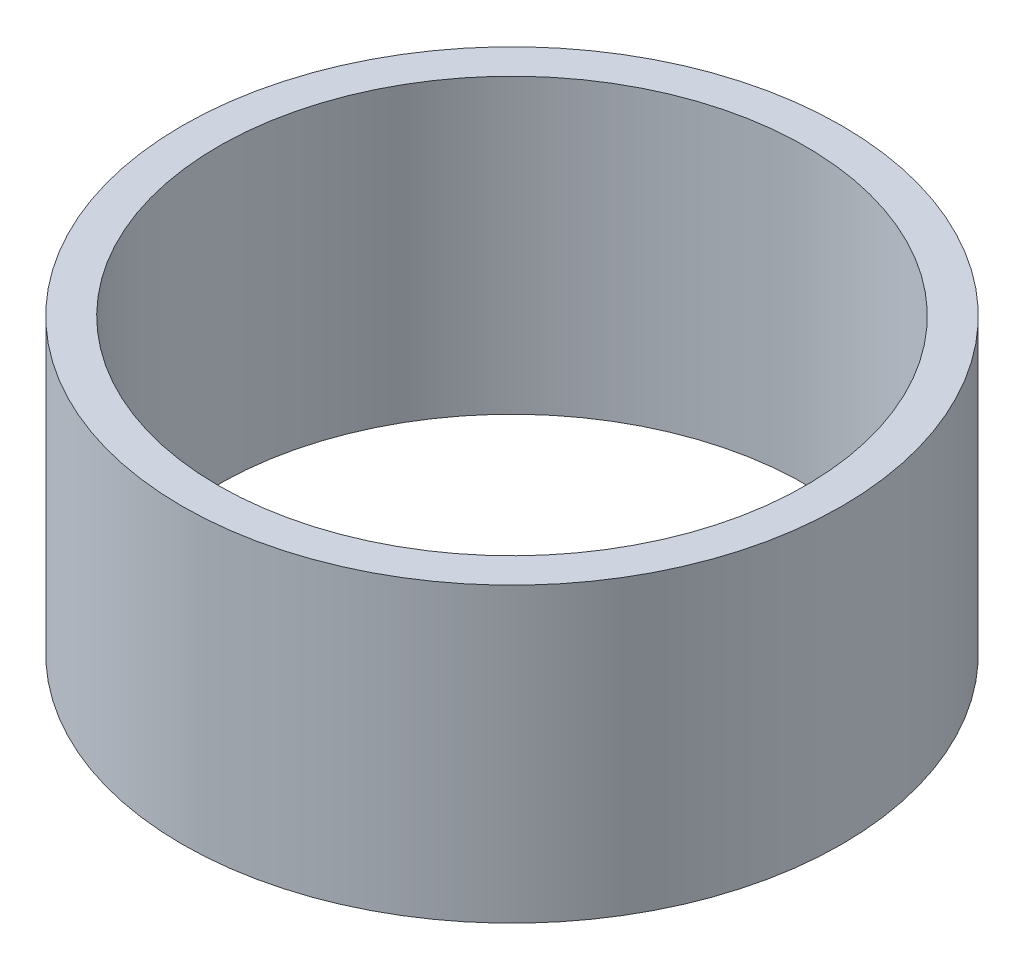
ISO-10303-21;
HEADER;
FILE_DESCRIPTION(('STEP AP214'),'2;1');
FILE_NAME('part.step','',(''),(''),'','','');
FILE_SCHEMA(('AUTOMOTIVE_DESIGN { 1 0 10303 214 1 1 1 1 }'));
ENDSEC;
DATA;
#1=APPLICATION_CONTEXT('core data for automotive mechanical design processes');
#2=APPLICATION_PROTOCOL_DEFINITION('international standard','automotive_design',2000,#1);
#3=PRODUCT_CONTEXT('',#1,'mechanical');
#4=PRODUCT('Part','Part','',(#3));
#5=PRODUCT_RELATED_PRODUCT_CATEGORY('part','',(#4));
#6=PRODUCT_DEFINITION_FORMATION('','',#4);
#7=PRODUCT_DEFINITION_CONTEXT('part definition',#1,'design');
#8=PRODUCT_DEFINITION('design','',#6,#7);
#9=PRODUCT_DEFINITION_SHAPE('','',#8);
#10=(LENGTH_UNIT() NAMED_UNIT(*) SI_UNIT(.MILLI.,.METRE.));
#11=(NAMED_UNIT(*) PLANE_ANGLE_UNIT() SI_UNIT($,.RADIAN.));
#12=(NAMED_UNIT(*) SI_UNIT($,.STERADIAN.) SOLID_ANGLE_UNIT());
#13=UNCERTAINTY_MEASURE_WITH_UNIT(LENGTH_MEASURE(1.E-05),#10,'distance_accuracy_value','');
#14=(GEOMETRIC_REPRESENTATION_CONTEXT(3) GLOBAL_UNCERTAINTY_ASSIGNED_CONTEXT((#13)) GLOBAL_UNIT_ASSIGNED_CONTEXT((#10,
#11,#12)) REPRESENTATION_CONTEXT('',''));
#15=CARTESIAN_POINT('',(0.,0.,0.));
#16=DIRECTION('',(0.,0.,1.));
#17=DIRECTION('',(1.,0.,0.));
#18=AXIS2_PLACEMENT_3D('',#15,#16,#17);
#19=CARTESIAN_POINT('',(0.,63.5,0.));
#20=DIRECTION('',(0.,-1.,0.));
#21=DIRECTION('',(0.,0.,-1.));
#22=AXIS2_PLACEMENT_3D('',#19,#20,#21);
#23=CYLINDRICAL_SURFACE('',#22,71.5157550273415);
#24=CARTESIAN_POINT('',(0.,63.5,0.));
#25=DIRECTION('',(0.,1.,0.));
#26=DIRECTION('',(0.,0.,1.));
#27=AXIS2_PLACEMENT_3D('',#24,#25,#26);
#28=CIRCLE('',#27,71.5157550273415);
#29=CARTESIAN_POINT('',(0.,63.5,71.5157550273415));
#30=VERTEX_POINT('',#29);
#31=EDGE_CURVE('E10',#30,#30,#28,.T.);
#32=ORIENTED_EDGE('',*,*,#31,.F.);
#33=EDGE_LOOP('',(#32));
#34=FACE_BOUND('',#33,.T.);
#35=CARTESIAN_POINT('',(0.,0.,0.));
#36=DIRECTION('',(0.,1.,0.));
#37=DIRECTION('',(0.,0.,1.));
#38=AXIS2_PLACEMENT_3D('',#35,#36,#37);
#39=CIRCLE('',#38,71.5157550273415);
#40=CARTESIAN_POINT('',(0.,0.,71.5157550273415));
#41=VERTEX_POINT('',#40);
#42=EDGE_CURVE('E36',#41,#41,#39,.T.);
#43=ORIENTED_EDGE('',*,*,#42,.T.);
#44=EDGE_LOOP('',(#43));
#45=FACE_BOUND('',#44,.T.);
#46=ADVANCED_FACE('F33',(#34,#45),#23,.T.);
#47=CARTESIAN_POINT('',(0.,63.5,0.));
#48=DIRECTION('',(0.,1.,0.));
#49=DIRECTION('',(0.,0.,1.));
#50=AXIS2_PLACEMENT_3D('',#47,#48,#49);
#51=PLANE('',#50);
#52=CARTESIAN_POINT('',(0.,63.5,0.));
#53=DIRECTION('',(0.,1.,0.));
#54=DIRECTION('',(0.,0.,1.));
#55=AXIS2_PLACEMENT_3D('',#52,#53,#54);
#56=CIRCLE('',#55,63.7032);
#57=CARTESIAN_POINT('',(0.,63.5,63.7032));
#58=VERTEX_POINT('',#57);
#59=EDGE_CURVE('E45',#58,#58,#56,.T.);
#60=ORIENTED_EDGE('',*,*,#59,.F.);
#61=EDGE_LOOP('',(#60));
#62=FACE_BOUND('',#61,.T.);
#63=ORIENTED_EDGE('',*,*,#31,.T.);
#64=EDGE_LOOP('',(#63));
#65=FACE_BOUND('',#64,.T.);
#66=ADVANCED_FACE('F60',(#62,#65),#51,.T.);
#67=CARTESIAN_POINT('',(0.,0.,0.));
#68=DIRECTION('',(0.,1.,0.));
#69=DIRECTION('',(0.,0.,1.));
#70=AXIS2_PLACEMENT_3D('',#67,#68,#69);
#71=PLANE('',#70);
#72=CARTESIAN_POINT('',(0.,0.,0.));
#73=DIRECTION('',(0.,1.,0.));
#74=DIRECTION('',(0.,0.,1.));
#75=AXIS2_PLACEMENT_3D('',#72,#73,#74);
#76=CIRCLE('',#75,63.7032);
#77=CARTESIAN_POINT('',(0.,0.,63.7032));
#78=VERTEX_POINT('',#77);
#79=EDGE_CURVE('E43',#78,#78,#76,.T.);
#80=ORIENTED_EDGE('',*,*,#79,.T.);
#81=EDGE_LOOP('',(#80));
#82=FACE_BOUND('',#81,.T.);
#83=ORIENTED_EDGE('',*,*,#42,.F.);
#84=EDGE_LOOP('',(#83));
#85=FACE_BOUND('',#84,.T.);
#86=ADVANCED_FACE('F51',(#82,#85),#71,.F.);
#87=CARTESIAN_POINT('',(0.,0.,0.));
#88=DIRECTION('',(0.,1.,0.));
#89=DIRECTION('',(0.,0.,1.));
#90=AXIS2_PLACEMENT_3D('',#87,#88,#89);
#91=CYLINDRICAL_SURFACE('',#90,63.7032);
#92=ORIENTED_EDGE('',*,*,#79,.F.);
#93=EDGE_LOOP('',(#92));
#94=FACE_BOUND('',#93,.T.);
#95=ORIENTED_EDGE('',*,*,#59,.T.);
#96=EDGE_LOOP('',(#95));
#97=FACE_BOUND('',#96,.T.);
#98=ADVANCED_FACE('F54',(#94,#97),#91,.F.);
#99=CLOSED_SHELL('',(#46,#66,#86,#98));
#100=MANIFOLD_SOLID_BREP('B2',#99);
#101=ADVANCED_BREP_SHAPE_REPRESENTATION('',(#18,#100),#14);
#102=SHAPE_DEFINITION_REPRESENTATION(#9,#101);
ENDSEC;
END-ISO-10303-21;
